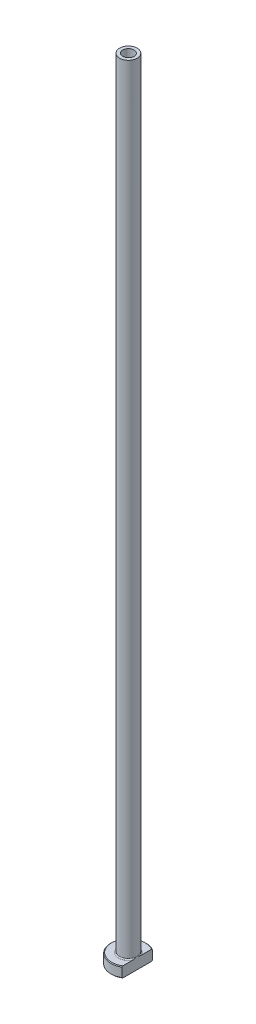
from build123d import *

# Parameters (mm, degrees)
FILLET1_R          = 0.3
CHAMFER1_SIZE      = 0.2
CUT_EXTRUDE1_DEPTH = 226.11108369
CHAMFER2_SIZE      = 0.5


with BuildPart() as part:
    # Sketch1 → Revolve1 (revolve)
    with BuildSketch(Plane.XY, mode=Mode.PRIVATE) as revolve1_sk:
        Polygon((-1.6, 225), (-2.5, 225), (-2.5, 3), (-5, 3), (-5, 0), (-1.85, 0), (-1.85, 168), (-1.6, 180), align=None)
    revolve(revolve1_sk.sketch.rotate(Axis((0, 92.187680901, 0), (0, -1, 0)), 270), axis=Axis((0, 92.187680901, 0), (0, -1, 0)))

    # Fillet1
    fillet1_edges = [part.edges().sort_by_distance(p)[0] for p in [
        (0, 3, -2.5),
    ]]
    fillet(fillet1_edges, radius=FILLET1_R)

    # Chamfer1
    chamfer1_edges = [part.edges().sort_by_distance(p)[0] for p in [
        (0, 0, -5),
        (0, 3, -5),
    ]]
    chamfer(chamfer1_edges, length=CHAMFER1_SIZE)

    # Sketch2 → Cut-Extrude1 (cut, through all)
    with BuildSketch(Plane.XZ):
        with BuildLine():
            Line((2.5, 4.330127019), (2.5, -4.330127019))
            ThreePointArc((2.5, -4.330127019), (5, 0), (2.5, 4.330127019))
        make_face()
    extrude(amount=-CUT_EXTRUDE1_DEPTH, mode=Mode.SUBTRACT)

    # Chamfer2
    chamfer2_edges = [part.edges().sort_by_distance(p)[0] for p in [
        (0, 0, -1.85),
    ]]
    chamfer(chamfer2_edges, length=CHAMFER2_SIZE)


solid = part.part
